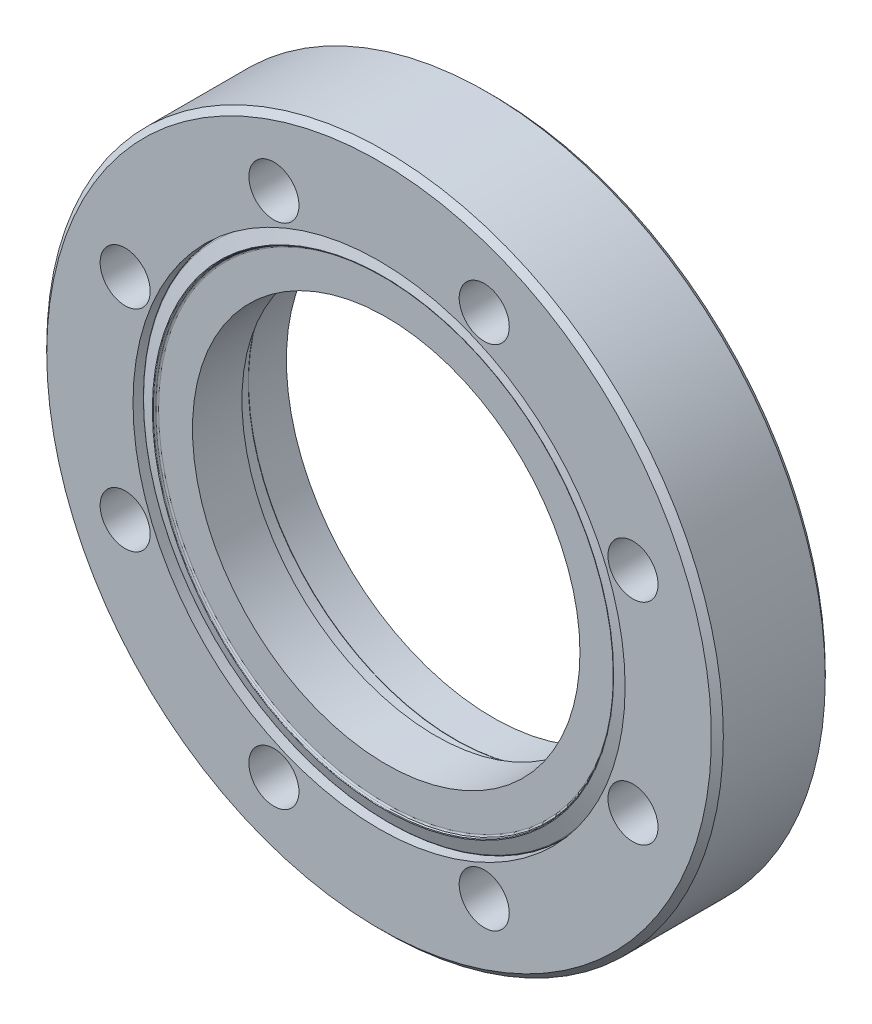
ISO-10303-21;
HEADER;
FILE_DESCRIPTION(('STEP AP214'),'2;1');
FILE_NAME('part.step','',(''),(''),'','','');
FILE_SCHEMA(('AUTOMOTIVE_DESIGN { 1 0 10303 214 1 1 1 1 }'));
ENDSEC;
DATA;
#1=APPLICATION_CONTEXT('core data for automotive mechanical design processes');
#2=APPLICATION_PROTOCOL_DEFINITION('international standard','automotive_design',2000,#1);
#3=PRODUCT_CONTEXT('',#1,'mechanical');
#4=PRODUCT('Part','Part','',(#3));
#5=PRODUCT_RELATED_PRODUCT_CATEGORY('part','',(#4));
#6=PRODUCT_DEFINITION_FORMATION('','',#4);
#7=PRODUCT_DEFINITION_CONTEXT('part definition',#1,'design');
#8=PRODUCT_DEFINITION('design','',#6,#7);
#9=PRODUCT_DEFINITION_SHAPE('','',#8);
#10=(LENGTH_UNIT() NAMED_UNIT(*) SI_UNIT(.MILLI.,.METRE.));
#11=(NAMED_UNIT(*) PLANE_ANGLE_UNIT() SI_UNIT($,.RADIAN.));
#12=(NAMED_UNIT(*) SI_UNIT($,.STERADIAN.) SOLID_ANGLE_UNIT());
#13=UNCERTAINTY_MEASURE_WITH_UNIT(LENGTH_MEASURE(1.E-05),#10,'distance_accuracy_value','');
#14=(GEOMETRIC_REPRESENTATION_CONTEXT(3) GLOBAL_UNCERTAINTY_ASSIGNED_CONTEXT((#13)) GLOBAL_UNIT_ASSIGNED_CONTEXT((#10,
#11,#12)) REPRESENTATION_CONTEXT('',''));
#15=CARTESIAN_POINT('',(0.,0.,0.));
#16=DIRECTION('',(0.,0.,1.));
#17=DIRECTION('',(1.,0.,0.));
#18=AXIS2_PLACEMENT_3D('',#15,#16,#17);
#19=CARTESIAN_POINT('',(0.,0.,18.3760307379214));
#20=DIRECTION('',(0.,0.,1.));
#21=DIRECTION('',(1.,0.,0.));
#22=AXIS2_PLACEMENT_3D('',#19,#20,#21);
#23=CONICAL_SURFACE('',#22,38.5707979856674,0.349065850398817);
#24=CARTESIAN_POINT('',(0.,0.,18.0973939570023));
#25=DIRECTION('',(0.,0.,1.));
#26=DIRECTION('',(1.,0.,0.));
#27=AXIS2_PLACEMENT_3D('',#24,#25,#26);
#28=CIRCLE('',#27,38.4693824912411);
#29=CARTESIAN_POINT('',(38.4693824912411,0.,18.0973939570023));
#30=VERTEX_POINT('',#29);
#31=EDGE_CURVE('E134',#30,#30,#28,.F.);
#32=ORIENTED_EDGE('',*,*,#31,.T.);
#33=EDGE_LOOP('',(#32));
#34=FACE_BOUND('',#33,.T.);
#35=CARTESIAN_POINT('',(0.,0.,18.3760307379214));
#36=DIRECTION('',(0.,0.,1.));
#37=DIRECTION('',(1.,0.,0.));
#38=AXIS2_PLACEMENT_3D('',#35,#36,#37);
#39=CIRCLE('',#38,38.5707979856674);
#40=CARTESIAN_POINT('',(38.5707979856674,0.,18.3760307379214));
#41=VERTEX_POINT('',#40);
#42=EDGE_CURVE('E45',#41,#41,#39,.F.);
#43=ORIENTED_EDGE('',*,*,#42,.F.);
#44=EDGE_LOOP('',(#43));
#45=FACE_BOUND('',#44,.T.);
#46=ADVANCED_FACE('F16',(#34,#45),#23,.F.);
#47=CARTESIAN_POINT('',(0.,0.,18.2));
#48=DIRECTION('',(0.,0.,1.));
#49=DIRECTION('',(1.,0.,0.));
#50=AXIS2_PLACEMENT_3D('',#47,#48,#49);
#51=TOROIDAL_SURFACE('',#50,38.1874747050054,0.3);
#52=ORIENTED_EDGE('',*,*,#31,.F.);
#53=EDGE_LOOP('',(#52));
#54=FACE_BOUND('',#53,.T.);
#55=CARTESIAN_POINT('',(0.,0.,17.9));
#56=DIRECTION('',(0.,0.,-1.));
#57=DIRECTION('',(1.,0.,0.));
#58=AXIS2_PLACEMENT_3D('',#55,#56,#57);
#59=CIRCLE('',#58,38.1874747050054);
#60=CARTESIAN_POINT('',(-38.1874747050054,0.,17.9));
#61=VERTEX_POINT('',#60);
#62=CARTESIAN_POINT('',(38.1874747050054,0.,17.9));
#63=VERTEX_POINT('',#62);
#64=EDGE_CURVE('E35',#61,#63,#59,.F.);
#65=ORIENTED_EDGE('',*,*,#64,.F.);
#66=CARTESIAN_POINT('',(0.,0.,17.9));
#67=DIRECTION('',(0.,0.,-1.));
#68=DIRECTION('',(-1.,0.,0.));
#69=AXIS2_PLACEMENT_3D('',#66,#67,#68);
#70=CIRCLE('',#69,38.1874747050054);
#71=EDGE_CURVE('E32',#63,#61,#70,.F.);
#72=ORIENTED_EDGE('',*,*,#71,.F.);
#73=EDGE_LOOP('',(#65,#72));
#74=FACE_BOUND('',#73,.T.);
#75=ADVANCED_FACE('F44',(#54,#74),#51,.F.);
#76=CARTESIAN_POINT('',(0.,0.,18.3418287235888));
#77=DIRECTION('',(0.,0.,1.));
#78=DIRECTION('',(1.,0.,0.));
#79=AXIS2_PLACEMENT_3D('',#76,#77,#78);
#80=TOROIDAL_SURFACE('',#79,38.664767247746,0.100000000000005);
#81=ORIENTED_EDGE('',*,*,#42,.T.);
#82=EDGE_LOOP('',(#81));
#83=FACE_BOUND('',#82,.T.);
#84=CARTESIAN_POINT('',(0.,0.,18.4357979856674));
#85=DIRECTION('',(0.,0.,-1.));
#86=DIRECTION('',(-1.,0.,0.));
#87=AXIS2_PLACEMENT_3D('',#84,#85,#86);
#88=CIRCLE('',#87,38.6989692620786);
#89=CARTESIAN_POINT('',(-38.6989692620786,0.,18.4357979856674));
#90=VERTEX_POINT('',#89);
#91=EDGE_CURVE('E41',#90,#90,#88,.T.);
#92=ORIENTED_EDGE('',*,*,#91,.F.);
#93=EDGE_LOOP('',(#92));
#94=FACE_BOUND('',#93,.T.);
#95=ADVANCED_FACE('F150',(#83,#94),#80,.T.);
#96=CARTESIAN_POINT('',(0.,0.,17.9));
#97=DIRECTION('',(0.,0.,1.));
#98=DIRECTION('',(1.,0.,0.));
#99=AXIS2_PLACEMENT_3D('',#96,#97,#98);
#100=PLANE('',#99);
#101=ORIENTED_EDGE('',*,*,#71,.T.);
#102=ORIENTED_EDGE('',*,*,#64,.T.);
#103=EDGE_LOOP('',(#101,#102));
#104=FACE_BOUND('',#103,.T.);
#105=CARTESIAN_POINT('',(0.,0.,17.9));
#106=DIRECTION('',(0.,0.,1.));
#107=DIRECTION('',(1.,0.,0.));
#108=AXIS2_PLACEMENT_3D('',#105,#106,#107);
#109=CIRCLE('',#108,32.5);
#110=CARTESIAN_POINT('',(32.5,0.,17.9));
#111=VERTEX_POINT('',#110);
#112=EDGE_CURVE('E47',#111,#111,#109,.F.);
#113=ORIENTED_EDGE('',*,*,#112,.T.);
#114=EDGE_LOOP('',(#113));
#115=FACE_BOUND('',#114,.T.);
#116=ADVANCED_FACE('F37',(#104,#115),#100,.T.);
#117=CARTESIAN_POINT('',(0.,0.,17.5973427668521));
#118=DIRECTION('',(0.,0.,-1.));
#119=DIRECTION('',(-1.,0.,0.));
#120=AXIS2_PLACEMENT_3D('',#117,#118,#119);
#121=CONICAL_SURFACE('',#120,41.0026060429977,1.22173047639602);
#122=CARTESIAN_POINT('',(0.,0.,17.5973427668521));
#123=DIRECTION('',(0.,0.,-1.));
#124=DIRECTION('',(-1.,0.,0.));
#125=AXIS2_PLACEMENT_3D('',#122,#123,#124);
#126=CIRCLE('',#125,41.0026060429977);
#127=CARTESIAN_POINT('',(-41.0026060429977,0.,17.5973427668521));
#128=VERTEX_POINT('',#127);
#129=EDGE_CURVE('E50',#128,#128,#126,.T.);
#130=ORIENTED_EDGE('',*,*,#129,.F.);
#131=EDGE_LOOP('',(#130));
#132=FACE_BOUND('',#131,.T.);
#133=ORIENTED_EDGE('',*,*,#91,.T.);
#134=EDGE_LOOP('',(#133));
#135=FACE_BOUND('',#134,.T.);
#136=ADVANCED_FACE('F169',(#132,#135),#121,.T.);
#137=CARTESIAN_POINT('',(0.,0.,31.5));
#138=DIRECTION('',(0.,0.,1.));
#139=DIRECTION('',(1.,0.,0.));
#140=AXIS2_PLACEMENT_3D('',#137,#138,#139);
#141=CYLINDRICAL_SURFACE('',#140,32.5);
#142=ORIENTED_EDGE('',*,*,#112,.F.);
#143=EDGE_LOOP('',(#142));
#144=FACE_BOUND('',#143,.T.);
#145=CARTESIAN_POINT('',(0.,0.,9.6));
#146=DIRECTION('',(0.,0.,1.));
#147=DIRECTION('',(1.,0.,0.));
#148=AXIS2_PLACEMENT_3D('',#145,#146,#147);
#149=CIRCLE('',#148,32.5);
#150=CARTESIAN_POINT('',(32.5,0.,9.6));
#151=VERTEX_POINT('',#150);
#152=EDGE_CURVE('E51',#151,#151,#149,.T.);
#153=ORIENTED_EDGE('',*,*,#152,.F.);
#154=EDGE_LOOP('',(#153));
#155=FACE_BOUND('',#154,.T.);
#156=ADVANCED_FACE('F190',(#144,#155),#141,.F.);
#157=CARTESIAN_POINT('',(0.,0.,17.3154349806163));
#158=DIRECTION('',(0.,0.,-1.));
#159=DIRECTION('',(-1.,0.,0.));
#160=AXIS2_PLACEMENT_3D('',#157,#158,#159);
#161=TOROIDAL_SURFACE('',#160,40.9,0.300000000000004);
#162=CARTESIAN_POINT('',(0.,0.,17.3154349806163));
#163=DIRECTION('',(0.,0.,-1.));
#164=DIRECTION('',(-1.,0.,0.));
#165=AXIS2_PLACEMENT_3D('',#162,#163,#164);
#166=CIRCLE('',#165,41.2);
#167=CARTESIAN_POINT('',(-41.2,0.,17.3154349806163));
#168=VERTEX_POINT('',#167);
#169=EDGE_CURVE('E54',#168,#168,#166,.T.);
#170=ORIENTED_EDGE('',*,*,#169,.F.);
#171=EDGE_LOOP('',(#170));
#172=FACE_BOUND('',#171,.T.);
#173=ORIENTED_EDGE('',*,*,#129,.T.);
#174=EDGE_LOOP('',(#173));
#175=FACE_BOUND('',#174,.T.);
#176=ADVANCED_FACE('F186',(#172,#175),#161,.T.);
#177=CARTESIAN_POINT('',(0.,32.5,9.6));
#178=DIRECTION('',(0.,0.,-1.));
#179=DIRECTION('',(-1.,0.,0.));
#180=AXIS2_PLACEMENT_3D('',#177,#178,#179);
#181=PLANE('',#180);
#182=CARTESIAN_POINT('',(0.,0.,9.6));
#183=DIRECTION('',(0.,0.,1.));
#184=DIRECTION('',(1.,0.,0.));
#185=AXIS2_PLACEMENT_3D('',#182,#183,#184);
#186=CIRCLE('',#185,34.65);
#187=CARTESIAN_POINT('',(34.65,0.,9.6));
#188=VERTEX_POINT('',#187);
#189=EDGE_CURVE('E55',#188,#188,#186,.F.);
#190=ORIENTED_EDGE('',*,*,#189,.T.);
#191=EDGE_LOOP('',(#190));
#192=FACE_BOUND('',#191,.T.);
#193=ORIENTED_EDGE('',*,*,#152,.T.);
#194=EDGE_LOOP('',(#193));
#195=FACE_BOUND('',#194,.T.);
#196=ADVANCED_FACE('F189',(#192,#195),#181,.T.);
#197=CARTESIAN_POINT('',(0.,0.,-24.6064148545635));
#198=DIRECTION('',(0.,0.,-1.));
#199=DIRECTION('',(-1.,0.,0.));
#200=AXIS2_PLACEMENT_3D('',#197,#198,#199);
#201=CYLINDRICAL_SURFACE('',#200,41.2);
#202=CARTESIAN_POINT('',(0.,0.,6.4));
#203=DIRECTION('',(0.,0.,-1.));
#204=DIRECTION('',(-1.,0.,0.));
#205=AXIS2_PLACEMENT_3D('',#202,#203,#204);
#206=CIRCLE('',#205,41.2);
#207=CARTESIAN_POINT('',(-41.2,0.,6.4));
#208=VERTEX_POINT('',#207);
#209=EDGE_CURVE('E58',#208,#208,#206,.F.);
#210=ORIENTED_EDGE('',*,*,#209,.T.);
#211=EDGE_LOOP('',(#210));
#212=FACE_BOUND('',#211,.T.);
#213=ORIENTED_EDGE('',*,*,#169,.T.);
#214=EDGE_LOOP('',(#213));
#215=FACE_BOUND('',#214,.T.);
#216=ADVANCED_FACE('F285',(#212,#215),#201,.T.);
#217=CARTESIAN_POINT('',(0.,0.,31.5));
#218=DIRECTION('',(0.,0.,1.));
#219=DIRECTION('',(1.,0.,0.));
#220=AXIS2_PLACEMENT_3D('',#217,#218,#219);
#221=CYLINDRICAL_SURFACE('',#220,34.65);
#222=CARTESIAN_POINT('',(0.,0.,6.4));
#223=DIRECTION('',(0.,0.,1.));
#224=DIRECTION('',(1.,0.,0.));
#225=AXIS2_PLACEMENT_3D('',#222,#223,#224);
#226=CIRCLE('',#225,34.65);
#227=CARTESIAN_POINT('',(34.65,0.,6.4));
#228=VERTEX_POINT('',#227);
#229=EDGE_CURVE('E61',#228,#228,#226,.F.);
#230=ORIENTED_EDGE('',*,*,#229,.T.);
#231=EDGE_LOOP('',(#230));
#232=FACE_BOUND('',#231,.T.);
#233=ORIENTED_EDGE('',*,*,#189,.F.);
#234=EDGE_LOOP('',(#233));
#235=FACE_BOUND('',#234,.T.);
#236=ADVANCED_FACE('F282',(#232,#235),#221,.F.);
#237=CARTESIAN_POINT('',(0.,41.275,6.4));
#238=DIRECTION('',(0.,0.,-1.));
#239=DIRECTION('',(-1.,0.,0.));
#240=AXIS2_PLACEMENT_3D('',#237,#238,#239);
#241=PLANE('',#240);
#242=ORIENTED_EDGE('',*,*,#209,.F.);
#243=EDGE_LOOP('',(#242));
#244=FACE_BOUND('',#243,.T.);
#245=CARTESIAN_POINT('',(0.,0.,6.4));
#246=DIRECTION('',(0.,0.,-1.));
#247=DIRECTION('',(-1.,0.,0.));
#248=AXIS2_PLACEMENT_3D('',#245,#246,#247);
#249=CIRCLE('',#248,41.275);
#250=CARTESIAN_POINT('',(-41.275,0.,6.4));
#251=VERTEX_POINT('',#250);
#252=EDGE_CURVE('E64',#251,#251,#249,.F.);
#253=ORIENTED_EDGE('',*,*,#252,.T.);
#254=EDGE_LOOP('',(#253));
#255=FACE_BOUND('',#254,.T.);
#256=ADVANCED_FACE('F278',(#244,#255),#241,.F.);
#257=CARTESIAN_POINT('',(0.,41.1,6.4));
#258=DIRECTION('',(0.,0.,1.));
#259=DIRECTION('',(1.,0.,0.));
#260=AXIS2_PLACEMENT_3D('',#257,#258,#259);
#261=PLANE('',#260);
#262=CARTESIAN_POINT('',(0.,0.,6.4));
#263=DIRECTION('',(0.,0.,-1.));
#264=DIRECTION('',(-1.,0.,0.));
#265=AXIS2_PLACEMENT_3D('',#262,#263,#264);
#266=CIRCLE('',#265,41.1);
#267=CARTESIAN_POINT('',(-41.1,0.,6.4));
#268=VERTEX_POINT('',#267);
#269=EDGE_CURVE('E67',#268,#268,#266,.T.);
#270=ORIENTED_EDGE('',*,*,#269,.T.);
#271=EDGE_LOOP('',(#270));
#272=FACE_BOUND('',#271,.T.);
#273=ORIENTED_EDGE('',*,*,#229,.F.);
#274=EDGE_LOOP('',(#273));
#275=FACE_BOUND('',#274,.T.);
#276=ADVANCED_FACE('F274',(#272,#275),#261,.F.);
#277=CARTESIAN_POINT('',(0.,0.,-24.6064148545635));
#278=DIRECTION('',(0.,0.,-1.));
#279=DIRECTION('',(-1.,0.,0.));
#280=AXIS2_PLACEMENT_3D('',#277,#278,#279);
#281=CYLINDRICAL_SURFACE('',#280,41.275);
#282=ORIENTED_EDGE('',*,*,#252,.F.);
#283=EDGE_LOOP('',(#282));
#284=FACE_BOUND('',#283,.T.);
#285=CARTESIAN_POINT('',(0.,0.,19.1));
#286=DIRECTION('',(0.,0.,-1.));
#287=DIRECTION('',(-1.,0.,0.));
#288=AXIS2_PLACEMENT_3D('',#285,#286,#287);
#289=CIRCLE('',#288,41.275);
#290=CARTESIAN_POINT('',(-41.275,0.,19.1));
#291=VERTEX_POINT('',#290);
#292=EDGE_CURVE('E71',#291,#291,#289,.T.);
#293=ORIENTED_EDGE('',*,*,#292,.F.);
#294=EDGE_LOOP('',(#293));
#295=FACE_BOUND('',#294,.T.);
#296=ADVANCED_FACE('F270',(#284,#295),#281,.F.);
#297=CARTESIAN_POINT('',(0.,0.,18.1));
#298=DIRECTION('',(0.,0.,-1.));
#299=DIRECTION('',(-1.,0.,0.));
#300=AXIS2_PLACEMENT_3D('',#297,#298,#299);
#301=CONICAL_SURFACE('',#300,56.75,0.78539816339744);
#302=CARTESIAN_POINT('',(0.,0.,18.1));
#303=DIRECTION('',(0.,0.,-1.));
#304=DIRECTION('',(-1.,0.,0.));
#305=AXIS2_PLACEMENT_3D('',#302,#303,#304);
#306=CIRCLE('',#305,56.75);
#307=CARTESIAN_POINT('',(-56.75,0.,18.1));
#308=VERTEX_POINT('',#307);
#309=EDGE_CURVE('E70',#308,#308,#306,.T.);
#310=ORIENTED_EDGE('',*,*,#309,.F.);
#311=EDGE_LOOP('',(#310));
#312=FACE_BOUND('',#311,.T.);
#313=CARTESIAN_POINT('',(0.,0.,19.1));
#314=DIRECTION('',(0.,0.,-1.));
#315=DIRECTION('',(-1.,0.,0.));
#316=AXIS2_PLACEMENT_3D('',#313,#314,#315);
#317=CIRCLE('',#316,55.75);
#318=CARTESIAN_POINT('',(-55.75,0.,19.1));
#319=VERTEX_POINT('',#318);
#320=EDGE_CURVE('E74',#319,#319,#317,.F.);
#321=ORIENTED_EDGE('',*,*,#320,.F.);
#322=EDGE_LOOP('',(#321));
#323=FACE_BOUND('',#322,.T.);
#324=ADVANCED_FACE('F266',(#312,#323),#301,.T.);
#325=CARTESIAN_POINT('',(0.,0.,-24.6064148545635));
#326=DIRECTION('',(0.,0.,-1.));
#327=DIRECTION('',(-1.,0.,0.));
#328=AXIS2_PLACEMENT_3D('',#325,#326,#327);
#329=CYLINDRICAL_SURFACE('',#328,41.1);
#330=ORIENTED_EDGE('',*,*,#269,.F.);
#331=EDGE_LOOP('',(#330));
#332=FACE_BOUND('',#331,.T.);
#333=CARTESIAN_POINT('',(0.,0.,6.35));
#334=DIRECTION('',(0.,0.,-1.));
#335=DIRECTION('',(-1.,0.,0.));
#336=AXIS2_PLACEMENT_3D('',#333,#334,#335);
#337=CIRCLE('',#336,41.1);
#338=CARTESIAN_POINT('',(-41.1,0.,6.35));
#339=VERTEX_POINT('',#338);
#340=EDGE_CURVE('E77',#339,#339,#337,.T.);
#341=ORIENTED_EDGE('',*,*,#340,.T.);
#342=EDGE_LOOP('',(#341));
#343=FACE_BOUND('',#342,.T.);
#344=ADVANCED_FACE('F262',(#332,#343),#329,.F.);
#345=CARTESIAN_POINT('',(0.,0.,19.1));
#346=DIRECTION('',(0.,0.,-1.));
#347=DIRECTION('',(-1.,0.,0.));
#348=AXIS2_PLACEMENT_3D('',#345,#346,#347);
#349=CYLINDRICAL_SURFACE('',#348,56.75);
#350=ORIENTED_EDGE('',*,*,#309,.T.);
#351=EDGE_LOOP('',(#350));
#352=FACE_BOUND('',#351,.T.);
#353=CARTESIAN_POINT('',(0.,0.,1.));
#354=DIRECTION('',(0.,0.,1.));
#355=DIRECTION('',(1.,0.,0.));
#356=AXIS2_PLACEMENT_3D('',#353,#354,#355);
#357=CIRCLE('',#356,56.75);
#358=CARTESIAN_POINT('',(56.75,0.,1.));
#359=VERTEX_POINT('',#358);
#360=EDGE_CURVE('E80',#359,#359,#357,.F.);
#361=ORIENTED_EDGE('',*,*,#360,.F.);
#362=EDGE_LOOP('',(#361));
#363=FACE_BOUND('',#362,.T.);
#364=ADVANCED_FACE('F258',(#352,#363),#349,.T.);
#365=CARTESIAN_POINT('',(0.,0.,19.1));
#366=DIRECTION('',(0.,0.,1.));
#367=DIRECTION('',(1.,0.,0.));
#368=AXIS2_PLACEMENT_3D('',#365,#366,#367);
#369=PLANE('',#368);
#370=ORIENTED_EDGE('',*,*,#320,.T.);
#371=EDGE_LOOP('',(#370));
#372=FACE_BOUND('',#371,.T.);
#373=CARTESIAN_POINT('',(17.6417062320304,42.5908464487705,19.1));
#374=DIRECTION('',(0.,0.,1.));
#375=DIRECTION('',(1.,0.,0.));
#376=AXIS2_PLACEMENT_3D('',#373,#374,#375);
#377=CIRCLE('',#376,4.2);
#378=CARTESIAN_POINT('',(21.8417062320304,42.5908464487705,19.1));
#379=VERTEX_POINT('',#378);
#380=EDGE_CURVE('E81',#379,#379,#377,.F.);
#381=ORIENTED_EDGE('',*,*,#380,.T.);
#382=EDGE_LOOP('',(#381));
#383=FACE_BOUND('',#382,.T.);
#384=CARTESIAN_POINT('',(-17.641706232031,42.5908464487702,19.1));
#385=DIRECTION('',(0.,0.,1.));
#386=DIRECTION('',(1.,0.,0.));
#387=AXIS2_PLACEMENT_3D('',#384,#385,#386);
#388=CIRCLE('',#387,4.2);
#389=CARTESIAN_POINT('',(-13.441706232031,42.5908464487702,19.1));
#390=VERTEX_POINT('',#389);
#391=EDGE_CURVE('E84',#390,#390,#388,.F.);
#392=ORIENTED_EDGE('',*,*,#391,.T.);
#393=EDGE_LOOP('',(#392));
#394=FACE_BOUND('',#393,.T.);
#395=CARTESIAN_POINT('',(-42.5908464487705,17.6417062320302,19.1));
#396=DIRECTION('',(0.,0.,1.));
#397=DIRECTION('',(1.,0.,0.));
#398=AXIS2_PLACEMENT_3D('',#395,#396,#397);
#399=CIRCLE('',#398,4.2);
#400=CARTESIAN_POINT('',(-38.3908464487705,17.6417062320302,19.1));
#401=VERTEX_POINT('',#400);
#402=EDGE_CURVE('E87',#401,#401,#399,.F.);
#403=ORIENTED_EDGE('',*,*,#402,.T.);
#404=EDGE_LOOP('',(#403));
#405=FACE_BOUND('',#404,.T.);
#406=CARTESIAN_POINT('',(-42.5908464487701,-17.6417062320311,19.1));
#407=DIRECTION('',(0.,0.,1.));
#408=DIRECTION('',(1.,0.,0.));
#409=AXIS2_PLACEMENT_3D('',#406,#407,#408);
#410=CIRCLE('',#409,4.2);
#411=CARTESIAN_POINT('',(-38.3908464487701,-17.6417062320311,19.1));
#412=VERTEX_POINT('',#411);
#413=EDGE_CURVE('E90',#412,#412,#410,.F.);
#414=ORIENTED_EDGE('',*,*,#413,.T.);
#415=EDGE_LOOP('',(#414));
#416=FACE_BOUND('',#415,.T.);
#417=CARTESIAN_POINT('',(-17.6417062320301,-42.5908464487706,19.1));
#418=DIRECTION('',(0.,0.,1.));
#419=DIRECTION('',(1.,0.,0.));
#420=AXIS2_PLACEMENT_3D('',#417,#418,#419);
#421=CIRCLE('',#420,4.2);
#422=CARTESIAN_POINT('',(-13.4417062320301,-42.5908464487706,19.1));
#423=VERTEX_POINT('',#422);
#424=EDGE_CURVE('E93',#423,#423,#421,.F.);
#425=ORIENTED_EDGE('',*,*,#424,.T.);
#426=EDGE_LOOP('',(#425));
#427=FACE_BOUND('',#426,.T.);
#428=CARTESIAN_POINT('',(17.6417062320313,-42.5908464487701,19.1));
#429=DIRECTION('',(0.,0.,1.));
#430=DIRECTION('',(1.,0.,0.));
#431=AXIS2_PLACEMENT_3D('',#428,#429,#430);
#432=CIRCLE('',#431,4.2);
#433=CARTESIAN_POINT('',(21.8417062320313,-42.5908464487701,19.1));
#434=VERTEX_POINT('',#433);
#435=EDGE_CURVE('E96',#434,#434,#432,.F.);
#436=ORIENTED_EDGE('',*,*,#435,.T.);
#437=EDGE_LOOP('',(#436));
#438=FACE_BOUND('',#437,.T.);
#439=CARTESIAN_POINT('',(42.5908464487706,-17.6417062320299,19.1));
#440=DIRECTION('',(0.,0.,1.));
#441=DIRECTION('',(1.,0.,0.));
#442=AXIS2_PLACEMENT_3D('',#439,#440,#441);
#443=CIRCLE('',#442,4.2);
#444=CARTESIAN_POINT('',(46.7908464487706,-17.6417062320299,19.1));
#445=VERTEX_POINT('',#444);
#446=EDGE_CURVE('E99',#445,#445,#443,.F.);
#447=ORIENTED_EDGE('',*,*,#446,.T.);
#448=EDGE_LOOP('',(#447));
#449=FACE_BOUND('',#448,.T.);
#450=CARTESIAN_POINT('',(42.59084644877,17.6417062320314,19.1));
#451=DIRECTION('',(0.,0.,1.));
#452=DIRECTION('',(1.,0.,0.));
#453=AXIS2_PLACEMENT_3D('',#450,#451,#452);
#454=CIRCLE('',#453,4.2);
#455=CARTESIAN_POINT('',(46.79084644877,17.6417062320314,19.1));
#456=VERTEX_POINT('',#455);
#457=EDGE_CURVE('E102',#456,#456,#454,.F.);
#458=ORIENTED_EDGE('',*,*,#457,.T.);
#459=EDGE_LOOP('',(#458));
#460=FACE_BOUND('',#459,.T.);
#461=ORIENTED_EDGE('',*,*,#292,.T.);
#462=EDGE_LOOP('',(#461));
#463=FACE_BOUND('',#462,.T.);
#464=ADVANCED_FACE('F254',(#372,#383,#394,#405,#416,#427,#438,#449,#460,#463),#369,.T.);
#465=CARTESIAN_POINT('',(0.,33.35,6.35));
#466=DIRECTION('',(0.,0.,-1.));
#467=DIRECTION('',(-1.,0.,0.));
#468=AXIS2_PLACEMENT_3D('',#465,#466,#467);
#469=PLANE('',#468);
#470=ORIENTED_EDGE('',*,*,#340,.F.);
#471=EDGE_LOOP('',(#470));
#472=FACE_BOUND('',#471,.T.);
#473=CARTESIAN_POINT('',(0.,0.,6.35));
#474=DIRECTION('',(0.,0.,1.));
#475=DIRECTION('',(1.,0.,0.));
#476=AXIS2_PLACEMENT_3D('',#473,#474,#475);
#477=CIRCLE('',#476,34.65);
#478=CARTESIAN_POINT('',(34.65,0.,6.35));
#479=VERTEX_POINT('',#478);
#480=EDGE_CURVE('E105',#479,#479,#477,.F.);
#481=ORIENTED_EDGE('',*,*,#480,.T.);
#482=EDGE_LOOP('',(#481));
#483=FACE_BOUND('',#482,.T.);
#484=ADVANCED_FACE('F250',(#472,#483),#469,.F.);
#485=CARTESIAN_POINT('',(0.,0.,1.));
#486=DIRECTION('',(0.,0.,1.));
#487=DIRECTION('',(1.,0.,0.));
#488=AXIS2_PLACEMENT_3D('',#485,#486,#487);
#489=CONICAL_SURFACE('',#488,56.75,0.785398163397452);
#490=CARTESIAN_POINT('',(0.,0.,0.));
#491=DIRECTION('',(0.,0.,1.));
#492=DIRECTION('',(1.,0.,0.));
#493=AXIS2_PLACEMENT_3D('',#490,#491,#492);
#494=CIRCLE('',#493,55.75);
#495=CARTESIAN_POINT('',(55.75,0.,0.));
#496=VERTEX_POINT('',#495);
#497=EDGE_CURVE('E108',#496,#496,#494,.T.);
#498=ORIENTED_EDGE('',*,*,#497,.T.);
#499=EDGE_LOOP('',(#498));
#500=FACE_BOUND('',#499,.T.);
#501=ORIENTED_EDGE('',*,*,#360,.T.);
#502=EDGE_LOOP('',(#501));
#503=FACE_BOUND('',#502,.T.);
#504=ADVANCED_FACE('F246',(#500,#503),#489,.T.);
#505=CARTESIAN_POINT('',(17.6417062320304,42.5908464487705,0.));
#506=DIRECTION('',(0.,0.,1.));
#507=DIRECTION('',(1.,0.,0.));
#508=AXIS2_PLACEMENT_3D('',#505,#506,#507);
#509=CYLINDRICAL_SURFACE('',#508,4.2);
#510=CARTESIAN_POINT('',(17.6417062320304,42.5908464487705,0.));
#511=DIRECTION('',(0.,0.,1.));
#512=DIRECTION('',(1.,0.,0.));
#513=AXIS2_PLACEMENT_3D('',#510,#511,#512);
#514=CIRCLE('',#513,4.2);
#515=CARTESIAN_POINT('',(21.8417062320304,42.5908464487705,0.));
#516=VERTEX_POINT('',#515);
#517=EDGE_CURVE('E111',#516,#516,#514,.F.);
#518=ORIENTED_EDGE('',*,*,#517,.T.);
#519=EDGE_LOOP('',(#518));
#520=FACE_BOUND('',#519,.T.);
#521=ORIENTED_EDGE('',*,*,#380,.F.);
#522=EDGE_LOOP('',(#521));
#523=FACE_BOUND('',#522,.T.);
#524=ADVANCED_FACE('F242',(#520,#523),#509,.F.);
#525=CARTESIAN_POINT('',(-17.641706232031,42.5908464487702,0.));
#526=DIRECTION('',(0.,0.,1.));
#527=DIRECTION('',(1.,0.,0.));
#528=AXIS2_PLACEMENT_3D('',#525,#526,#527);
#529=CYLINDRICAL_SURFACE('',#528,4.2);
#530=CARTESIAN_POINT('',(-17.641706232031,42.5908464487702,0.));
#531=DIRECTION('',(0.,0.,1.));
#532=DIRECTION('',(1.,0.,0.));
#533=AXIS2_PLACEMENT_3D('',#530,#531,#532);
#534=CIRCLE('',#533,4.2);
#535=CARTESIAN_POINT('',(-13.441706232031,42.5908464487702,0.));
#536=VERTEX_POINT('',#535);
#537=EDGE_CURVE('E114',#536,#536,#534,.F.);
#538=ORIENTED_EDGE('',*,*,#537,.T.);
#539=EDGE_LOOP('',(#538));
#540=FACE_BOUND('',#539,.T.);
#541=ORIENTED_EDGE('',*,*,#391,.F.);
#542=EDGE_LOOP('',(#541));
#543=FACE_BOUND('',#542,.T.);
#544=ADVANCED_FACE('F238',(#540,#543),#529,.F.);
#545=CARTESIAN_POINT('',(-42.5908464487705,17.6417062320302,0.));
#546=DIRECTION('',(0.,0.,1.));
#547=DIRECTION('',(1.,0.,0.));
#548=AXIS2_PLACEMENT_3D('',#545,#546,#547);
#549=CYLINDRICAL_SURFACE('',#548,4.2);
#550=CARTESIAN_POINT('',(-42.5908464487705,17.6417062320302,0.));
#551=DIRECTION('',(0.,0.,1.));
#552=DIRECTION('',(1.,0.,0.));
#553=AXIS2_PLACEMENT_3D('',#550,#551,#552);
#554=CIRCLE('',#553,4.2);
#555=CARTESIAN_POINT('',(-38.3908464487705,17.6417062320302,0.));
#556=VERTEX_POINT('',#555);
#557=EDGE_CURVE('E117',#556,#556,#554,.F.);
#558=ORIENTED_EDGE('',*,*,#557,.T.);
#559=EDGE_LOOP('',(#558));
#560=FACE_BOUND('',#559,.T.);
#561=ORIENTED_EDGE('',*,*,#402,.F.);
#562=EDGE_LOOP('',(#561));
#563=FACE_BOUND('',#562,.T.);
#564=ADVANCED_FACE('F234',(#560,#563),#549,.F.);
#565=CARTESIAN_POINT('',(-42.5908464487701,-17.6417062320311,0.));
#566=DIRECTION('',(0.,0.,1.));
#567=DIRECTION('',(1.,0.,0.));
#568=AXIS2_PLACEMENT_3D('',#565,#566,#567);
#569=CYLINDRICAL_SURFACE('',#568,4.2);
#570=CARTESIAN_POINT('',(-42.5908464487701,-17.6417062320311,0.));
#571=DIRECTION('',(0.,0.,1.));
#572=DIRECTION('',(1.,0.,0.));
#573=AXIS2_PLACEMENT_3D('',#570,#571,#572);
#574=CIRCLE('',#573,4.2);
#575=CARTESIAN_POINT('',(-38.3908464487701,-17.6417062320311,0.));
#576=VERTEX_POINT('',#575);
#577=EDGE_CURVE('E120',#576,#576,#574,.F.);
#578=ORIENTED_EDGE('',*,*,#577,.T.);
#579=EDGE_LOOP('',(#578));
#580=FACE_BOUND('',#579,.T.);
#581=ORIENTED_EDGE('',*,*,#413,.F.);
#582=EDGE_LOOP('',(#581));
#583=FACE_BOUND('',#582,.T.);
#584=ADVANCED_FACE('F230',(#580,#583),#569,.F.);
#585=CARTESIAN_POINT('',(-17.6417062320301,-42.5908464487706,0.));
#586=DIRECTION('',(0.,0.,1.));
#587=DIRECTION('',(1.,0.,0.));
#588=AXIS2_PLACEMENT_3D('',#585,#586,#587);
#589=CYLINDRICAL_SURFACE('',#588,4.2);
#590=CARTESIAN_POINT('',(-17.6417062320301,-42.5908464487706,0.));
#591=DIRECTION('',(0.,0.,1.));
#592=DIRECTION('',(1.,0.,0.));
#593=AXIS2_PLACEMENT_3D('',#590,#591,#592);
#594=CIRCLE('',#593,4.2);
#595=CARTESIAN_POINT('',(-13.4417062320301,-42.5908464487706,0.));
#596=VERTEX_POINT('',#595);
#597=EDGE_CURVE('E123',#596,#596,#594,.F.);
#598=ORIENTED_EDGE('',*,*,#597,.T.);
#599=EDGE_LOOP('',(#598));
#600=FACE_BOUND('',#599,.T.);
#601=ORIENTED_EDGE('',*,*,#424,.F.);
#602=EDGE_LOOP('',(#601));
#603=FACE_BOUND('',#602,.T.);
#604=ADVANCED_FACE('F226',(#600,#603),#589,.F.);
#605=CARTESIAN_POINT('',(17.6417062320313,-42.5908464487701,0.));
#606=DIRECTION('',(0.,0.,1.));
#607=DIRECTION('',(1.,0.,0.));
#608=AXIS2_PLACEMENT_3D('',#605,#606,#607);
#609=CYLINDRICAL_SURFACE('',#608,4.2);
#610=CARTESIAN_POINT('',(17.6417062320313,-42.5908464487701,0.));
#611=DIRECTION('',(0.,0.,1.));
#612=DIRECTION('',(1.,0.,0.));
#613=AXIS2_PLACEMENT_3D('',#610,#611,#612);
#614=CIRCLE('',#613,4.2);
#615=CARTESIAN_POINT('',(21.8417062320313,-42.5908464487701,0.));
#616=VERTEX_POINT('',#615);
#617=EDGE_CURVE('E126',#616,#616,#614,.F.);
#618=ORIENTED_EDGE('',*,*,#617,.T.);
#619=EDGE_LOOP('',(#618));
#620=FACE_BOUND('',#619,.T.);
#621=ORIENTED_EDGE('',*,*,#435,.F.);
#622=EDGE_LOOP('',(#621));
#623=FACE_BOUND('',#622,.T.);
#624=ADVANCED_FACE('F222',(#620,#623),#609,.F.);
#625=CARTESIAN_POINT('',(42.5908464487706,-17.6417062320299,0.));
#626=DIRECTION('',(0.,0.,1.));
#627=DIRECTION('',(1.,0.,0.));
#628=AXIS2_PLACEMENT_3D('',#625,#626,#627);
#629=CYLINDRICAL_SURFACE('',#628,4.2);
#630=CARTESIAN_POINT('',(42.5908464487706,-17.6417062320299,0.));
#631=DIRECTION('',(0.,0.,1.));
#632=DIRECTION('',(1.,0.,0.));
#633=AXIS2_PLACEMENT_3D('',#630,#631,#632);
#634=CIRCLE('',#633,4.2);
#635=CARTESIAN_POINT('',(46.7908464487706,-17.6417062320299,0.));
#636=VERTEX_POINT('',#635);
#637=EDGE_CURVE('E129',#636,#636,#634,.F.);
#638=ORIENTED_EDGE('',*,*,#637,.T.);
#639=EDGE_LOOP('',(#638));
#640=FACE_BOUND('',#639,.T.);
#641=ORIENTED_EDGE('',*,*,#446,.F.);
#642=EDGE_LOOP('',(#641));
#643=FACE_BOUND('',#642,.T.);
#644=ADVANCED_FACE('F218',(#640,#643),#629,.F.);
#645=CARTESIAN_POINT('',(42.59084644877,17.6417062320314,0.));
#646=DIRECTION('',(0.,0.,1.));
#647=DIRECTION('',(1.,0.,0.));
#648=AXIS2_PLACEMENT_3D('',#645,#646,#647);
#649=CYLINDRICAL_SURFACE('',#648,4.2);
#650=CARTESIAN_POINT('',(42.59084644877,17.6417062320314,0.));
#651=DIRECTION('',(0.,0.,1.));
#652=DIRECTION('',(1.,0.,0.));
#653=AXIS2_PLACEMENT_3D('',#650,#651,#652);
#654=CIRCLE('',#653,4.2);
#655=CARTESIAN_POINT('',(46.79084644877,17.6417062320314,0.));
#656=VERTEX_POINT('',#655);
#657=EDGE_CURVE('E26',#656,#656,#654,.F.);
#658=ORIENTED_EDGE('',*,*,#657,.T.);
#659=EDGE_LOOP('',(#658));
#660=FACE_BOUND('',#659,.T.);
#661=ORIENTED_EDGE('',*,*,#457,.F.);
#662=EDGE_LOOP('',(#661));
#663=FACE_BOUND('',#662,.T.);
#664=ADVANCED_FACE('F210',(#660,#663),#649,.F.);
#665=CARTESIAN_POINT('',(0.,0.,31.5));
#666=DIRECTION('',(0.,0.,1.));
#667=DIRECTION('',(1.,0.,0.));
#668=AXIS2_PLACEMENT_3D('',#665,#666,#667);
#669=CYLINDRICAL_SURFACE('',#668,34.65);
#670=CARTESIAN_POINT('',(0.,0.,0.));
#671=DIRECTION('',(0.,0.,1.));
#672=DIRECTION('',(1.,0.,0.));
#673=AXIS2_PLACEMENT_3D('',#670,#671,#672);
#674=CIRCLE('',#673,34.65);
#675=CARTESIAN_POINT('',(34.65,0.,0.));
#676=VERTEX_POINT('',#675);
#677=EDGE_CURVE('E11',#676,#676,#674,.F.);
#678=ORIENTED_EDGE('',*,*,#677,.T.);
#679=EDGE_LOOP('',(#678));
#680=FACE_BOUND('',#679,.T.);
#681=ORIENTED_EDGE('',*,*,#480,.F.);
#682=EDGE_LOOP('',(#681));
#683=FACE_BOUND('',#682,.T.);
#684=ADVANCED_FACE('F204',(#680,#683),#669,.F.);
#685=CARTESIAN_POINT('',(0.,0.,0.));
#686=DIRECTION('',(0.,0.,1.));
#687=DIRECTION('',(1.,0.,0.));
#688=AXIS2_PLACEMENT_3D('',#685,#686,#687);
#689=PLANE('',#688);
#690=ORIENTED_EDGE('',*,*,#677,.F.);
#691=EDGE_LOOP('',(#690));
#692=FACE_BOUND('',#691,.T.);
#693=ORIENTED_EDGE('',*,*,#657,.F.);
#694=EDGE_LOOP('',(#693));
#695=FACE_BOUND('',#694,.T.);
#696=ORIENTED_EDGE('',*,*,#637,.F.);
#697=EDGE_LOOP('',(#696));
#698=FACE_BOUND('',#697,.T.);
#699=ORIENTED_EDGE('',*,*,#617,.F.);
#700=EDGE_LOOP('',(#699));
#701=FACE_BOUND('',#700,.T.);
#702=ORIENTED_EDGE('',*,*,#597,.F.);
#703=EDGE_LOOP('',(#702));
#704=FACE_BOUND('',#703,.T.);
#705=ORIENTED_EDGE('',*,*,#577,.F.);
#706=EDGE_LOOP('',(#705));
#707=FACE_BOUND('',#706,.T.);
#708=ORIENTED_EDGE('',*,*,#557,.F.);
#709=EDGE_LOOP('',(#708));
#710=FACE_BOUND('',#709,.T.);
#711=ORIENTED_EDGE('',*,*,#537,.F.);
#712=EDGE_LOOP('',(#711));
#713=FACE_BOUND('',#712,.T.);
#714=ORIENTED_EDGE('',*,*,#517,.F.);
#715=EDGE_LOOP('',(#714));
#716=FACE_BOUND('',#715,.T.);
#717=ORIENTED_EDGE('',*,*,#497,.F.);
#718=EDGE_LOOP('',(#717));
#719=FACE_BOUND('',#718,.T.);
#720=ADVANCED_FACE('F202',(#692,#695,#698,#701,#704,#707,#710,#713,#716,#719),#689,.F.);
#721=CLOSED_SHELL('',(#46,#75,#95,#116,#136,#156,#176,#196,#216,#236,#256,#276,#296,#324,#344,
#364,#464,#484,#504,#524,#544,#564,#584,#604,#624,#644,#664,#684,#720));
#722=MANIFOLD_SOLID_BREP('B1',#721);
#723=ADVANCED_BREP_SHAPE_REPRESENTATION('',(#18,#722),#14);
#724=SHAPE_DEFINITION_REPRESENTATION(#9,#723);
ENDSEC;
END-ISO-10303-21;
